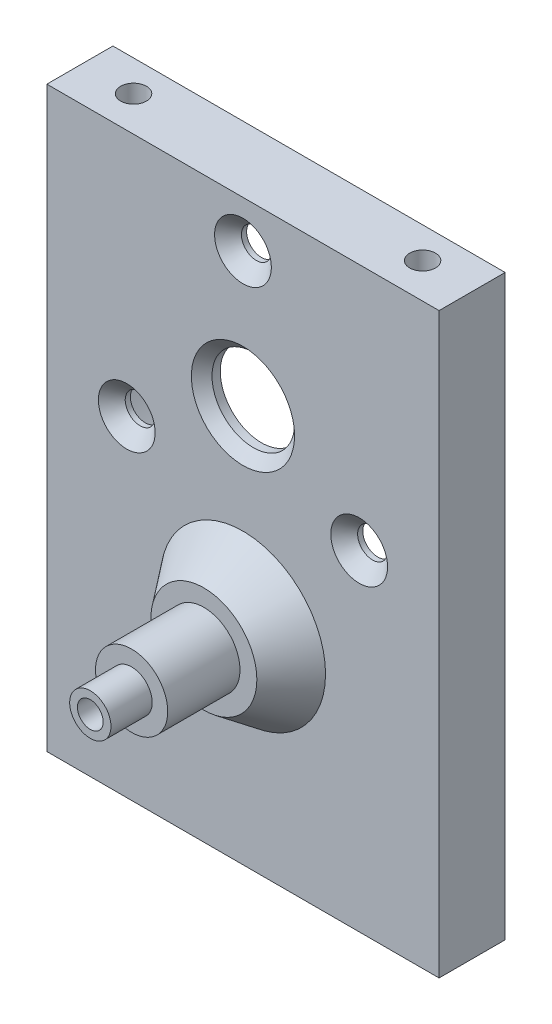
ISO-10303-21;
HEADER;
FILE_DESCRIPTION(('STEP AP214'),'2;1');
FILE_NAME('part.step','',(''),(''),'','','');
FILE_SCHEMA(('AUTOMOTIVE_DESIGN { 1 0 10303 214 1 1 1 1 }'));
ENDSEC;
DATA;
#1=APPLICATION_CONTEXT('core data for automotive mechanical design processes');
#2=APPLICATION_PROTOCOL_DEFINITION('international standard','automotive_design',2000,#1);
#3=PRODUCT_CONTEXT('',#1,'mechanical');
#4=PRODUCT('Part','Part','',(#3));
#5=PRODUCT_RELATED_PRODUCT_CATEGORY('part','',(#4));
#6=PRODUCT_DEFINITION_FORMATION('','',#4);
#7=PRODUCT_DEFINITION_CONTEXT('part definition',#1,'design');
#8=PRODUCT_DEFINITION('design','',#6,#7);
#9=PRODUCT_DEFINITION_SHAPE('','',#8);
#10=(LENGTH_UNIT() NAMED_UNIT(*) SI_UNIT(.MILLI.,.METRE.));
#11=(NAMED_UNIT(*) PLANE_ANGLE_UNIT() SI_UNIT($,.RADIAN.));
#12=(NAMED_UNIT(*) SI_UNIT($,.STERADIAN.) SOLID_ANGLE_UNIT());
#13=UNCERTAINTY_MEASURE_WITH_UNIT(LENGTH_MEASURE(1.E-05),#10,'distance_accuracy_value','');
#14=(GEOMETRIC_REPRESENTATION_CONTEXT(3) GLOBAL_UNCERTAINTY_ASSIGNED_CONTEXT((#13)) GLOBAL_UNIT_ASSIGNED_CONTEXT((#10,
#11,#12)) REPRESENTATION_CONTEXT('',''));
#15=CARTESIAN_POINT('',(0.,0.,0.));
#16=DIRECTION('',(0.,0.,1.));
#17=DIRECTION('',(1.,0.,0.));
#18=AXIS2_PLACEMENT_3D('',#15,#16,#17);
#19=CARTESIAN_POINT('',(0.,20.,17.19));
#20=DIRECTION('',(0.,0.,1.));
#21=DIRECTION('',(1.,0.,0.));
#22=AXIS2_PLACEMENT_3D('',#19,#20,#21);
#23=PLANE('',#22);
#24=CARTESIAN_POINT('',(0.,20.,17.19));
#25=DIRECTION('',(0.,0.,1.));
#26=DIRECTION('',(1.,0.,0.));
#27=AXIS2_PLACEMENT_3D('',#24,#25,#26);
#28=CIRCLE('',#27,3.5);
#29=CARTESIAN_POINT('',(3.5,20.,17.19));
#30=VERTEX_POINT('',#29);
#31=EDGE_CURVE('E115',#30,#30,#28,.T.);
#32=ORIENTED_EDGE('',*,*,#31,.T.);
#33=EDGE_LOOP('',(#32));
#34=FACE_BOUND('',#33,.T.);
#35=CARTESIAN_POINT('',(0.,20.,17.19));
#36=DIRECTION('',(0.,0.,1.));
#37=DIRECTION('',(1.,0.,0.));
#38=AXIS2_PLACEMENT_3D('',#35,#36,#37);
#39=CIRCLE('',#38,2.);
#40=CARTESIAN_POINT('',(2.,20.,17.19));
#41=VERTEX_POINT('',#40);
#42=EDGE_CURVE('E101',#41,#41,#39,.T.);
#43=ORIENTED_EDGE('',*,*,#42,.F.);
#44=EDGE_LOOP('',(#43));
#45=FACE_BOUND('',#44,.T.);
#46=ADVANCED_FACE('F38',(#34,#45),#23,.T.);
#47=CARTESIAN_POINT('',(0.,20.,10.19));
#48=DIRECTION('',(0.,0.,1.));
#49=DIRECTION('',(1.,0.,0.));
#50=AXIS2_PLACEMENT_3D('',#47,#48,#49);
#51=PLANE('',#50);
#52=CARTESIAN_POINT('',(0.,20.,10.19));
#53=DIRECTION('',(0.,0.,1.));
#54=DIRECTION('',(1.,0.,0.));
#55=AXIS2_PLACEMENT_3D('',#52,#53,#54);
#56=CIRCLE('',#55,5.13421550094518);
#57=CARTESIAN_POINT('',(5.13421550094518,20.,10.19));
#58=VERTEX_POINT('',#57);
#59=EDGE_CURVE('E180',#58,#58,#56,.T.);
#60=ORIENTED_EDGE('',*,*,#59,.T.);
#61=EDGE_LOOP('',(#60));
#62=FACE_BOUND('',#61,.T.);
#63=CARTESIAN_POINT('',(0.,20.,10.19));
#64=DIRECTION('',(0.,0.,1.));
#65=DIRECTION('',(1.,0.,0.));
#66=AXIS2_PLACEMENT_3D('',#63,#64,#65);
#67=CIRCLE('',#66,3.5);
#68=CARTESIAN_POINT('',(3.5,20.,10.19));
#69=VERTEX_POINT('',#68);
#70=EDGE_CURVE('E113',#69,#69,#67,.T.);
#71=ORIENTED_EDGE('',*,*,#70,.F.);
#72=EDGE_LOOP('',(#71));
#73=FACE_BOUND('',#72,.T.);
#74=ADVANCED_FACE('F201',(#62,#73),#51,.T.);
#75=CARTESIAN_POINT('',(0.,38.5,4.6));
#76=DIRECTION('',(0.,0.,-1.));
#77=DIRECTION('',(-1.,0.,0.));
#78=AXIS2_PLACEMENT_3D('',#75,#76,#77);
#79=PLANE('',#78);
#80=CARTESIAN_POINT('',(-11.2583302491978,32.,4.6));
#81=DIRECTION('',(0.,0.,-1.));
#82=DIRECTION('',(-1.,0.,0.));
#83=AXIS2_PLACEMENT_3D('',#80,#81,#82);
#84=CIRCLE('',#83,1.44999999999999);
#85=CARTESIAN_POINT('',(-12.7083302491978,32.,4.6));
#86=VERTEX_POINT('',#85);
#87=EDGE_CURVE('E143',#86,#86,#84,.F.);
#88=ORIENTED_EDGE('',*,*,#87,.T.);
#89=EDGE_LOOP('',(#88));
#90=FACE_BOUND('',#89,.T.);
#91=CARTESIAN_POINT('',(0.,38.5,4.6));
#92=DIRECTION('',(0.,0.,-1.));
#93=DIRECTION('',(-1.,0.,0.));
#94=AXIS2_PLACEMENT_3D('',#91,#92,#93);
#95=CIRCLE('',#94,4.00000000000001);
#96=CARTESIAN_POINT('',(-4.00000000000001,38.5,4.6));
#97=VERTEX_POINT('',#96);
#98=EDGE_CURVE('E142',#97,#97,#95,.T.);
#99=ORIENTED_EDGE('',*,*,#98,.F.);
#100=EDGE_LOOP('',(#99));
#101=FACE_BOUND('',#100,.T.);
#102=CARTESIAN_POINT('',(0.,38.5,4.6));
#103=DIRECTION('',(0.,0.,-1.));
#104=DIRECTION('',(-1.,0.,0.));
#105=AXIS2_PLACEMENT_3D('',#102,#103,#104);
#106=CIRCLE('',#105,16.54);
#107=CARTESIAN_POINT('',(-16.54,38.5,4.6));
#108=VERTEX_POINT('',#107);
#109=EDGE_CURVE('E151',#108,#108,#106,.T.);
#110=ORIENTED_EDGE('',*,*,#109,.T.);
#111=EDGE_LOOP('',(#110));
#112=FACE_BOUND('',#111,.T.);
#113=CARTESIAN_POINT('',(11.2583302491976,31.9999999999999,4.6));
#114=DIRECTION('',(0.,0.,-1.));
#115=DIRECTION('',(-1.,0.,0.));
#116=AXIS2_PLACEMENT_3D('',#113,#114,#115);
#117=CIRCLE('',#116,1.44999999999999);
#118=CARTESIAN_POINT('',(9.80833024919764,31.9999999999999,4.6));
#119=VERTEX_POINT('',#118);
#120=EDGE_CURVE('E134',#119,#119,#117,.F.);
#121=ORIENTED_EDGE('',*,*,#120,.T.);
#122=EDGE_LOOP('',(#121));
#123=FACE_BOUND('',#122,.T.);
#124=CARTESIAN_POINT('',(0.,51.5,4.6));
#125=DIRECTION('',(0.,0.,-1.));
#126=DIRECTION('',(-1.,0.,0.));
#127=AXIS2_PLACEMENT_3D('',#124,#125,#126);
#128=CIRCLE('',#127,1.44999999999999);
#129=CARTESIAN_POINT('',(-1.44999999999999,51.5,4.6));
#130=VERTEX_POINT('',#129);
#131=EDGE_CURVE('E125',#130,#130,#128,.F.);
#132=ORIENTED_EDGE('',*,*,#131,.T.);
#133=EDGE_LOOP('',(#132));
#134=FACE_BOUND('',#133,.T.);
#135=ADVANCED_FACE('F207',(#90,#101,#112,#123,#134),#79,.T.);
#136=CARTESIAN_POINT('',(19.,56.,6.4));
#137=DIRECTION('',(0.,0.,1.));
#138=DIRECTION('',(1.,0.,0.));
#139=AXIS2_PLACEMENT_3D('',#136,#137,#138);
#140=PLANE('',#139);
#141=CARTESIAN_POINT('',(0.,38.5,6.4));
#142=DIRECTION('',(0.,0.,1.));
#143=DIRECTION('',(1.,0.,0.));
#144=AXIS2_PLACEMENT_3D('',#141,#142,#143);
#145=CIRCLE('',#144,5.);
#146=CARTESIAN_POINT('',(5.,38.5,6.4));
#147=VERTEX_POINT('',#146);
#148=EDGE_CURVE('E47',#147,#147,#145,.F.);
#149=ORIENTED_EDGE('',*,*,#148,.T.);
#150=EDGE_LOOP('',(#149));
#151=FACE_BOUND('',#150,.T.);
#152=CARTESIAN_POINT('',(0.,20.,6.4));
#153=DIRECTION('',(0.,0.,1.));
#154=DIRECTION('',(1.,0.,0.));
#155=AXIS2_PLACEMENT_3D('',#152,#153,#154);
#156=CIRCLE('',#155,8.);
#157=CARTESIAN_POINT('',(8.,20.,6.4));
#158=VERTEX_POINT('',#157);
#159=EDGE_CURVE('E177',#158,#158,#156,.F.);
#160=ORIENTED_EDGE('',*,*,#159,.T.);
#161=EDGE_LOOP('',(#160));
#162=FACE_BOUND('',#161,.T.);
#163=CARTESIAN_POINT('',(0.,51.5,6.4));
#164=DIRECTION('',(0.,0.,1.));
#165=DIRECTION('',(1.,0.,0.));
#166=AXIS2_PLACEMENT_3D('',#163,#164,#165);
#167=CIRCLE('',#166,2.75);
#168=CARTESIAN_POINT('',(2.75,51.5,6.4));
#169=VERTEX_POINT('',#168);
#170=EDGE_CURVE('E118',#169,#169,#167,.T.);
#171=ORIENTED_EDGE('',*,*,#170,.F.);
#172=EDGE_LOOP('',(#171));
#173=FACE_BOUND('',#172,.T.);
#174=CARTESIAN_POINT('',(11.2583302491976,31.9999999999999,6.4));
#175=DIRECTION('',(0.,0.,1.));
#176=DIRECTION('',(1.,0.,0.));
#177=AXIS2_PLACEMENT_3D('',#174,#175,#176);
#178=CIRCLE('',#177,2.75);
#179=CARTESIAN_POINT('',(14.0083302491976,31.9999999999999,6.4));
#180=VERTEX_POINT('',#179);
#181=EDGE_CURVE('E124',#180,#180,#178,.T.);
#182=ORIENTED_EDGE('',*,*,#181,.F.);
#183=EDGE_LOOP('',(#182));
#184=FACE_BOUND('',#183,.T.);
#185=CARTESIAN_POINT('',(-11.2583302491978,32.,6.4));
#186=DIRECTION('',(0.,0.,1.));
#187=DIRECTION('',(1.,0.,0.));
#188=AXIS2_PLACEMENT_3D('',#185,#186,#187);
#189=CIRCLE('',#188,2.75);
#190=CARTESIAN_POINT('',(-8.50833024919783,32.,6.4));
#191=VERTEX_POINT('',#190);
#192=EDGE_CURVE('E133',#191,#191,#189,.T.);
#193=ORIENTED_EDGE('',*,*,#192,.F.);
#194=EDGE_LOOP('',(#193));
#195=FACE_BOUND('',#194,.T.);
#196=DIRECTION('',(0.,1.,0.));
#197=VECTOR('',#196,1.);
#198=CARTESIAN_POINT('',(19.,0.,6.4));
#199=LINE('',#198,#197);
#200=CARTESIAN_POINT('',(19.,0.,6.4));
#201=VERTEX_POINT('',#200);
#202=CARTESIAN_POINT('',(19.,56.,6.4));
#203=VERTEX_POINT('',#202);
#204=EDGE_CURVE('E157',#201,#203,#199,.T.);
#205=ORIENTED_EDGE('',*,*,#204,.T.);
#206=DIRECTION('',(-1.,0.,0.));
#207=VECTOR('',#206,1.);
#208=CARTESIAN_POINT('',(19.,56.,6.4));
#209=LINE('',#208,#207);
#210=CARTESIAN_POINT('',(-19.,56.,6.4));
#211=VERTEX_POINT('',#210);
#212=EDGE_CURVE('E87',#203,#211,#209,.T.);
#213=ORIENTED_EDGE('',*,*,#212,.T.);
#214=DIRECTION('',(0.,-1.,0.));
#215=VECTOR('',#214,1.);
#216=CARTESIAN_POINT('',(-19.,56.,6.4));
#217=LINE('',#216,#215);
#218=CARTESIAN_POINT('',(-19.,0.,6.4));
#219=VERTEX_POINT('',#218);
#220=EDGE_CURVE('E160',#211,#219,#217,.T.);
#221=ORIENTED_EDGE('',*,*,#220,.T.);
#222=DIRECTION('',(1.,0.,0.));
#223=VECTOR('',#222,1.);
#224=CARTESIAN_POINT('',(-19.,0.,6.4));
#225=LINE('',#224,#223);
#226=EDGE_CURVE('E55',#219,#201,#225,.T.);
#227=ORIENTED_EDGE('',*,*,#226,.T.);
#228=EDGE_LOOP('',(#205,#213,#221,#227));
#229=FACE_BOUND('',#228,.T.);
#230=ADVANCED_FACE('F185',(#151,#162,#173,#184,#195,#229),#140,.T.);
#231=CARTESIAN_POINT('',(19.,56.,0.));
#232=DIRECTION('',(0.,0.,1.));
#233=DIRECTION('',(1.,0.,0.));
#234=AXIS2_PLACEMENT_3D('',#231,#232,#233);
#235=PLANE('',#234);
#236=DIRECTION('',(0.,1.,0.));
#237=VECTOR('',#236,1.);
#238=CARTESIAN_POINT('',(19.,0.,0.));
#239=LINE('',#238,#237);
#240=CARTESIAN_POINT('',(19.,0.,0.));
#241=VERTEX_POINT('',#240);
#242=CARTESIAN_POINT('',(19.,56.,0.));
#243=VERTEX_POINT('',#242);
#244=EDGE_CURVE('E154',#241,#243,#239,.T.);
#245=ORIENTED_EDGE('',*,*,#244,.F.);
#246=DIRECTION('',(1.,0.,0.));
#247=VECTOR('',#246,1.);
#248=CARTESIAN_POINT('',(-19.,0.,0.));
#249=LINE('',#248,#247);
#250=CARTESIAN_POINT('',(-19.,0.,0.));
#251=VERTEX_POINT('',#250);
#252=EDGE_CURVE('E79',#251,#241,#249,.T.);
#253=ORIENTED_EDGE('',*,*,#252,.F.);
#254=DIRECTION('',(0.,-1.,0.));
#255=VECTOR('',#254,1.);
#256=CARTESIAN_POINT('',(-19.,56.,0.));
#257=LINE('',#256,#255);
#258=CARTESIAN_POINT('',(-19.,56.,0.));
#259=VERTEX_POINT('',#258);
#260=EDGE_CURVE('E73',#259,#251,#257,.T.);
#261=ORIENTED_EDGE('',*,*,#260,.F.);
#262=DIRECTION('',(-1.,0.,0.));
#263=VECTOR('',#262,1.);
#264=CARTESIAN_POINT('',(19.,56.,0.));
#265=LINE('',#264,#263);
#266=EDGE_CURVE('E166',#243,#259,#265,.T.);
#267=ORIENTED_EDGE('',*,*,#266,.F.);
#268=EDGE_LOOP('',(#245,#253,#261,#267));
#269=FACE_BOUND('',#268,.T.);
#270=CARTESIAN_POINT('',(0.,38.5,0.));
#271=DIRECTION('',(0.,0.,-1.));
#272=DIRECTION('',(-1.,0.,0.));
#273=AXIS2_PLACEMENT_3D('',#270,#271,#272);
#274=CIRCLE('',#273,16.54);
#275=CARTESIAN_POINT('',(-16.54,38.5,0.));
#276=VERTEX_POINT('',#275);
#277=EDGE_CURVE('E150',#276,#276,#274,.T.);
#278=ORIENTED_EDGE('',*,*,#277,.F.);
#279=EDGE_LOOP('',(#278));
#280=FACE_BOUND('',#279,.T.);
#281=ADVANCED_FACE('F257',(#269,#280),#235,.F.);
#282=CARTESIAN_POINT('',(19.,0.,6.4));
#283=DIRECTION('',(-1.,0.,0.));
#284=DIRECTION('',(0.,0.,1.));
#285=AXIS2_PLACEMENT_3D('',#282,#283,#284);
#286=PLANE('',#285);
#287=ORIENTED_EDGE('',*,*,#244,.T.);
#288=DIRECTION('',(0.,0.,-1.));
#289=VECTOR('',#288,1.);
#290=CARTESIAN_POINT('',(19.,56.,6.4));
#291=LINE('',#290,#289);
#292=EDGE_CURVE('E175',#203,#243,#291,.T.);
#293=ORIENTED_EDGE('',*,*,#292,.F.);
#294=ORIENTED_EDGE('',*,*,#204,.F.);
#295=DIRECTION('',(0.,0.,-1.));
#296=VECTOR('',#295,1.);
#297=CARTESIAN_POINT('',(19.,0.,6.4));
#298=LINE('',#297,#296);
#299=EDGE_CURVE('E163',#201,#241,#298,.T.);
#300=ORIENTED_EDGE('',*,*,#299,.T.);
#301=EDGE_LOOP('',(#287,#293,#294,#300));
#302=FACE_BOUND('',#301,.T.);
#303=ADVANCED_FACE('F260',(#302),#286,.F.);
#304=CARTESIAN_POINT('',(19.,56.,6.4));
#305=DIRECTION('',(0.,-1.,0.));
#306=DIRECTION('',(1.,0.,0.));
#307=AXIS2_PLACEMENT_3D('',#304,#305,#306);
#308=PLANE('',#307);
#309=CARTESIAN_POINT('',(-14.,56.,3.));
#310=DIRECTION('',(0.,1.,0.));
#311=DIRECTION('',(-1.,0.,0.));
#312=AXIS2_PLACEMENT_3D('',#309,#310,#311);
#313=CIRCLE('',#312,1.25);
#314=CARTESIAN_POINT('',(-15.25,56.,3.));
#315=VERTEX_POINT('',#314);
#316=EDGE_CURVE('E381',#315,#315,#313,.T.);
#317=ORIENTED_EDGE('',*,*,#316,.F.);
#318=EDGE_LOOP('',(#317));
#319=FACE_BOUND('',#318,.T.);
#320=CARTESIAN_POINT('',(14.,56.,3.));
#321=DIRECTION('',(0.,1.,0.));
#322=DIRECTION('',(1.,0.,0.));
#323=AXIS2_PLACEMENT_3D('',#320,#321,#322);
#324=CIRCLE('',#323,1.25);
#325=CARTESIAN_POINT('',(15.25,56.,3.));
#326=VERTEX_POINT('',#325);
#327=EDGE_CURVE('E359',#326,#326,#324,.T.);
#328=ORIENTED_EDGE('',*,*,#327,.F.);
#329=EDGE_LOOP('',(#328));
#330=FACE_BOUND('',#329,.T.);
#331=ORIENTED_EDGE('',*,*,#266,.T.);
#332=DIRECTION('',(0.,0.,-1.));
#333=VECTOR('',#332,1.);
#334=CARTESIAN_POINT('',(-19.,56.,6.4));
#335=LINE('',#334,#333);
#336=EDGE_CURVE('E173',#211,#259,#335,.T.);
#337=ORIENTED_EDGE('',*,*,#336,.F.);
#338=ORIENTED_EDGE('',*,*,#212,.F.);
#339=ORIENTED_EDGE('',*,*,#292,.T.);
#340=EDGE_LOOP('',(#331,#337,#338,#339));
#341=FACE_BOUND('',#340,.T.);
#342=ADVANCED_FACE('F268',(#319,#330,#341),#308,.F.);
#343=CARTESIAN_POINT('',(-19.,56.,6.4));
#344=DIRECTION('',(1.,0.,0.));
#345=DIRECTION('',(0.,0.,-1.));
#346=AXIS2_PLACEMENT_3D('',#343,#344,#345);
#347=PLANE('',#346);
#348=ORIENTED_EDGE('',*,*,#260,.T.);
#349=DIRECTION('',(0.,0.,-1.));
#350=VECTOR('',#349,1.);
#351=CARTESIAN_POINT('',(-19.,0.,6.4));
#352=LINE('',#351,#350);
#353=EDGE_CURVE('E171',#219,#251,#352,.T.);
#354=ORIENTED_EDGE('',*,*,#353,.F.);
#355=ORIENTED_EDGE('',*,*,#220,.F.);
#356=ORIENTED_EDGE('',*,*,#336,.T.);
#357=EDGE_LOOP('',(#348,#354,#355,#356));
#358=FACE_BOUND('',#357,.T.);
#359=ADVANCED_FACE('F264',(#358),#347,.F.);
#360=CARTESIAN_POINT('',(-19.,0.,6.4));
#361=DIRECTION('',(0.,1.,0.));
#362=DIRECTION('',(0.,0.,1.));
#363=AXIS2_PLACEMENT_3D('',#360,#361,#362);
#364=PLANE('',#363);
#365=CARTESIAN_POINT('',(12.,0.,3.));
#366=DIRECTION('',(0.,-1.,0.));
#367=DIRECTION('',(0.,0.,-1.));
#368=AXIS2_PLACEMENT_3D('',#365,#366,#367);
#369=CIRCLE('',#368,1.25);
#370=CARTESIAN_POINT('',(12.,0.,1.75));
#371=VERTEX_POINT('',#370);
#372=EDGE_CURVE('E360',#371,#371,#369,.T.);
#373=ORIENTED_EDGE('',*,*,#372,.F.);
#374=EDGE_LOOP('',(#373));
#375=FACE_BOUND('',#374,.T.);
#376=CARTESIAN_POINT('',(0.,0.,3.));
#377=DIRECTION('',(0.,-1.,0.));
#378=DIRECTION('',(0.,0.,-1.));
#379=AXIS2_PLACEMENT_3D('',#376,#377,#378);
#380=CIRCLE('',#379,1.25);
#381=CARTESIAN_POINT('',(0.,0.,1.75));
#382=VERTEX_POINT('',#381);
#383=EDGE_CURVE('E370',#382,#382,#380,.T.);
#384=ORIENTED_EDGE('',*,*,#383,.F.);
#385=EDGE_LOOP('',(#384));
#386=FACE_BOUND('',#385,.T.);
#387=CARTESIAN_POINT('',(-12.,0.,3.));
#388=DIRECTION('',(0.,-1.,0.));
#389=DIRECTION('',(0.,0.,1.));
#390=AXIS2_PLACEMENT_3D('',#387,#388,#389);
#391=CIRCLE('',#390,1.25);
#392=CARTESIAN_POINT('',(-12.,0.,4.25));
#393=VERTEX_POINT('',#392);
#394=EDGE_CURVE('E376',#393,#393,#391,.T.);
#395=ORIENTED_EDGE('',*,*,#394,.F.);
#396=EDGE_LOOP('',(#395));
#397=FACE_BOUND('',#396,.T.);
#398=ORIENTED_EDGE('',*,*,#252,.T.);
#399=ORIENTED_EDGE('',*,*,#299,.F.);
#400=ORIENTED_EDGE('',*,*,#226,.F.);
#401=ORIENTED_EDGE('',*,*,#353,.T.);
#402=EDGE_LOOP('',(#398,#399,#400,#401));
#403=FACE_BOUND('',#402,.T.);
#404=ADVANCED_FACE('F253',(#375,#386,#397,#403),#364,.F.);
#405=CARTESIAN_POINT('',(0.,38.5,4.6));
#406=DIRECTION('',(0.,0.,-1.));
#407=DIRECTION('',(-1.,0.,0.));
#408=AXIS2_PLACEMENT_3D('',#405,#406,#407);
#409=CYLINDRICAL_SURFACE('',#408,16.54);
#410=ORIENTED_EDGE('',*,*,#277,.T.);
#411=EDGE_LOOP('',(#410));
#412=FACE_BOUND('',#411,.T.);
#413=ORIENTED_EDGE('',*,*,#109,.F.);
#414=EDGE_LOOP('',(#413));
#415=FACE_BOUND('',#414,.T.);
#416=ADVANCED_FACE('F246',(#412,#415),#409,.F.);
#417=CARTESIAN_POINT('',(0.,38.5,6.4));
#418=DIRECTION('',(0.,0.,-1.));
#419=DIRECTION('',(-1.,0.,0.));
#420=AXIS2_PLACEMENT_3D('',#417,#418,#419);
#421=CYLINDRICAL_SURFACE('',#420,4.00000000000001);
#422=CARTESIAN_POINT('',(0.,38.5,5.40000000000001));
#423=DIRECTION('',(0.,0.,1.));
#424=DIRECTION('',(1.,0.,0.));
#425=AXIS2_PLACEMENT_3D('',#422,#423,#424);
#426=CIRCLE('',#425,4.00000000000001);
#427=CARTESIAN_POINT('',(4.00000000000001,38.5,5.40000000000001));
#428=VERTEX_POINT('',#427);
#429=EDGE_CURVE('E11',#428,#428,#426,.T.);
#430=ORIENTED_EDGE('',*,*,#429,.T.);
#431=EDGE_LOOP('',(#430));
#432=FACE_BOUND('',#431,.T.);
#433=ORIENTED_EDGE('',*,*,#98,.T.);
#434=EDGE_LOOP('',(#433));
#435=FACE_BOUND('',#434,.T.);
#436=ADVANCED_FACE('F239',(#432,#435),#421,.F.);
#437=CARTESIAN_POINT('',(-11.2583302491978,32.,6.4));
#438=DIRECTION('',(0.,0.,1.));
#439=DIRECTION('',(1.,0.,0.));
#440=AXIS2_PLACEMENT_3D('',#437,#438,#439);
#441=CYLINDRICAL_SURFACE('',#440,1.44999999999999);
#442=ORIENTED_EDGE('',*,*,#87,.F.);
#443=EDGE_LOOP('',(#442));
#444=FACE_BOUND('',#443,.T.);
#445=CARTESIAN_POINT('',(-11.2583302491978,32.,5.09999999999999));
#446=DIRECTION('',(0.,0.,1.));
#447=DIRECTION('',(1.,0.,0.));
#448=AXIS2_PLACEMENT_3D('',#445,#446,#447);
#449=CIRCLE('',#448,1.44999999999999);
#450=CARTESIAN_POINT('',(-9.80833024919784,32.,5.09999999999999));
#451=VERTEX_POINT('',#450);
#452=EDGE_CURVE('E139',#451,#451,#449,.T.);
#453=ORIENTED_EDGE('',*,*,#452,.T.);
#454=EDGE_LOOP('',(#453));
#455=FACE_BOUND('',#454,.T.);
#456=ADVANCED_FACE('F236',(#444,#455),#441,.F.);
#457=CARTESIAN_POINT('',(-11.2583302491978,32.,6.4));
#458=DIRECTION('',(0.,0.,1.));
#459=DIRECTION('',(1.,0.,0.));
#460=AXIS2_PLACEMENT_3D('',#457,#458,#459);
#461=CONICAL_SURFACE('',#460,2.75,0.785398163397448);
#462=ORIENTED_EDGE('',*,*,#452,.F.);
#463=EDGE_LOOP('',(#462));
#464=FACE_BOUND('',#463,.T.);
#465=ORIENTED_EDGE('',*,*,#192,.T.);
#466=EDGE_LOOP('',(#465));
#467=FACE_BOUND('',#466,.T.);
#468=ADVANCED_FACE('F231',(#464,#467),#461,.F.);
#469=CARTESIAN_POINT('',(11.2583302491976,31.9999999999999,6.4));
#470=DIRECTION('',(0.,0.,1.));
#471=DIRECTION('',(1.,0.,0.));
#472=AXIS2_PLACEMENT_3D('',#469,#470,#471);
#473=CYLINDRICAL_SURFACE('',#472,1.44999999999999);
#474=ORIENTED_EDGE('',*,*,#120,.F.);
#475=EDGE_LOOP('',(#474));
#476=FACE_BOUND('',#475,.T.);
#477=CARTESIAN_POINT('',(11.2583302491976,31.9999999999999,5.09999999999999));
#478=DIRECTION('',(0.,0.,1.));
#479=DIRECTION('',(1.,0.,0.));
#480=AXIS2_PLACEMENT_3D('',#477,#478,#479);
#481=CIRCLE('',#480,1.44999999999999);
#482=CARTESIAN_POINT('',(12.7083302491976,31.9999999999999,5.09999999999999));
#483=VERTEX_POINT('',#482);
#484=EDGE_CURVE('E130',#483,#483,#481,.T.);
#485=ORIENTED_EDGE('',*,*,#484,.T.);
#486=EDGE_LOOP('',(#485));
#487=FACE_BOUND('',#486,.T.);
#488=ADVANCED_FACE('F228',(#476,#487),#473,.F.);
#489=CARTESIAN_POINT('',(11.2583302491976,31.9999999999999,6.4));
#490=DIRECTION('',(0.,0.,1.));
#491=DIRECTION('',(1.,0.,0.));
#492=AXIS2_PLACEMENT_3D('',#489,#490,#491);
#493=CONICAL_SURFACE('',#492,2.75,0.785398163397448);
#494=ORIENTED_EDGE('',*,*,#484,.F.);
#495=EDGE_LOOP('',(#494));
#496=FACE_BOUND('',#495,.T.);
#497=ORIENTED_EDGE('',*,*,#181,.T.);
#498=EDGE_LOOP('',(#497));
#499=FACE_BOUND('',#498,.T.);
#500=ADVANCED_FACE('F223',(#496,#499),#493,.F.);
#501=CARTESIAN_POINT('',(0.,51.5,6.4));
#502=DIRECTION('',(0.,0.,1.));
#503=DIRECTION('',(1.,0.,0.));
#504=AXIS2_PLACEMENT_3D('',#501,#502,#503);
#505=CYLINDRICAL_SURFACE('',#504,1.44999999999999);
#506=ORIENTED_EDGE('',*,*,#131,.F.);
#507=EDGE_LOOP('',(#506));
#508=FACE_BOUND('',#507,.T.);
#509=CARTESIAN_POINT('',(0.,51.5,5.09999999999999));
#510=DIRECTION('',(0.,0.,1.));
#511=DIRECTION('',(1.,0.,0.));
#512=AXIS2_PLACEMENT_3D('',#509,#510,#511);
#513=CIRCLE('',#512,1.44999999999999);
#514=CARTESIAN_POINT('',(1.44999999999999,51.5,5.09999999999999));
#515=VERTEX_POINT('',#514);
#516=EDGE_CURVE('E121',#515,#515,#513,.T.);
#517=ORIENTED_EDGE('',*,*,#516,.T.);
#518=EDGE_LOOP('',(#517));
#519=FACE_BOUND('',#518,.T.);
#520=ADVANCED_FACE('F220',(#508,#519),#505,.F.);
#521=CARTESIAN_POINT('',(0.,51.5,6.4));
#522=DIRECTION('',(0.,0.,1.));
#523=DIRECTION('',(1.,0.,0.));
#524=AXIS2_PLACEMENT_3D('',#521,#522,#523);
#525=CONICAL_SURFACE('',#524,2.75,0.785398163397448);
#526=ORIENTED_EDGE('',*,*,#516,.F.);
#527=EDGE_LOOP('',(#526));
#528=FACE_BOUND('',#527,.T.);
#529=ORIENTED_EDGE('',*,*,#170,.T.);
#530=EDGE_LOOP('',(#529));
#531=FACE_BOUND('',#530,.T.);
#532=ADVANCED_FACE('F217',(#528,#531),#525,.F.);
#533=CARTESIAN_POINT('',(0.,20.,17.19));
#534=DIRECTION('',(0.,0.,-1.));
#535=DIRECTION('',(-1.,0.,0.));
#536=AXIS2_PLACEMENT_3D('',#533,#534,#535);
#537=CYLINDRICAL_SURFACE('',#536,3.5);
#538=ORIENTED_EDGE('',*,*,#31,.F.);
#539=EDGE_LOOP('',(#538));
#540=FACE_BOUND('',#539,.T.);
#541=ORIENTED_EDGE('',*,*,#70,.T.);
#542=EDGE_LOOP('',(#541));
#543=FACE_BOUND('',#542,.T.);
#544=ADVANCED_FACE('F215',(#540,#543),#537,.T.);
#545=CARTESIAN_POINT('',(0.,20.,21.19));
#546=DIRECTION('',(0.,0.,-1.));
#547=DIRECTION('',(-1.,0.,0.));
#548=AXIS2_PLACEMENT_3D('',#545,#546,#547);
#549=CYLINDRICAL_SURFACE('',#548,2.);
#550=CARTESIAN_POINT('',(0.,20.,21.19));
#551=DIRECTION('',(0.,0.,1.));
#552=DIRECTION('',(1.,0.,0.));
#553=AXIS2_PLACEMENT_3D('',#550,#551,#552);
#554=CIRCLE('',#553,2.);
#555=CARTESIAN_POINT('',(2.,20.,21.19));
#556=VERTEX_POINT('',#555);
#557=EDGE_CURVE('E105',#556,#556,#554,.T.);
#558=ORIENTED_EDGE('',*,*,#557,.F.);
#559=EDGE_LOOP('',(#558));
#560=FACE_BOUND('',#559,.T.);
#561=ORIENTED_EDGE('',*,*,#42,.T.);
#562=EDGE_LOOP('',(#561));
#563=FACE_BOUND('',#562,.T.);
#564=ADVANCED_FACE('F213',(#560,#563),#549,.T.);
#565=CARTESIAN_POINT('',(0.,20.,21.19));
#566=DIRECTION('',(0.,0.,1.));
#567=DIRECTION('',(1.,0.,0.));
#568=AXIS2_PLACEMENT_3D('',#565,#566,#567);
#569=PLANE('',#568);
#570=CARTESIAN_POINT('',(0.,20.,21.19));
#571=DIRECTION('',(0.,0.,1.));
#572=DIRECTION('',(1.,0.,0.));
#573=AXIS2_PLACEMENT_3D('',#570,#571,#572);
#574=CIRCLE('',#573,1.24999999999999);
#575=CARTESIAN_POINT('',(1.24999999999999,20.,21.19));
#576=VERTEX_POINT('',#575);
#577=EDGE_CURVE('E102',#576,#576,#574,.T.);
#578=ORIENTED_EDGE('',*,*,#577,.F.);
#579=EDGE_LOOP('',(#578));
#580=FACE_BOUND('',#579,.T.);
#581=ORIENTED_EDGE('',*,*,#557,.T.);
#582=EDGE_LOOP('',(#581));
#583=FACE_BOUND('',#582,.T.);
#584=ADVANCED_FACE('F275',(#580,#583),#569,.T.);
#585=CARTESIAN_POINT('',(0.,20.,11.69));
#586=DIRECTION('',(0.,0.,-1.));
#587=DIRECTION('',(-1.,0.,0.));
#588=AXIS2_PLACEMENT_3D('',#585,#586,#587);
#589=CONICAL_SURFACE('',#588,4.,0.647421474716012);
#590=ORIENTED_EDGE('',*,*,#159,.F.);
#591=EDGE_LOOP('',(#590));
#592=FACE_BOUND('',#591,.T.);
#593=ORIENTED_EDGE('',*,*,#59,.F.);
#594=EDGE_LOOP('',(#593));
#595=FACE_BOUND('',#594,.T.);
#596=ADVANCED_FACE('F95',(#592,#595),#589,.T.);
#597=CARTESIAN_POINT('',(0.,20.,11.19));
#598=DIRECTION('',(0.,0.,1.));
#599=DIRECTION('',(1.,0.,0.));
#600=AXIS2_PLACEMENT_3D('',#597,#598,#599);
#601=CONICAL_SURFACE('',#600,1.25,1.02974425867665);
#602=CARTESIAN_POINT('',(0.,20.,10.4389242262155));
#603=VERTEX_POINT('',#602);
#604=VERTEX_LOOP('',#603);
#605=FACE_BOUND('',#604,.T.);
#606=CARTESIAN_POINT('',(0.,20.,11.19));
#607=DIRECTION('',(0.,0.,1.));
#608=DIRECTION('',(1.,0.,0.));
#609=AXIS2_PLACEMENT_3D('',#606,#607,#608);
#610=CIRCLE('',#609,1.25);
#611=CARTESIAN_POINT('',(1.25,20.,11.19));
#612=VERTEX_POINT('',#611);
#613=EDGE_CURVE('E99',#612,#612,#610,.T.);
#614=ORIENTED_EDGE('',*,*,#613,.T.);
#615=EDGE_LOOP('',(#614));
#616=FACE_BOUND('',#615,.T.);
#617=ADVANCED_FACE('F91',(#605,#616),#601,.F.);
#618=CARTESIAN_POINT('',(0.,20.,21.19));
#619=DIRECTION('',(0.,0.,1.));
#620=DIRECTION('',(1.,0.,0.));
#621=AXIS2_PLACEMENT_3D('',#618,#619,#620);
#622=CYLINDRICAL_SURFACE('',#621,1.24999999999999);
#623=ORIENTED_EDGE('',*,*,#613,.F.);
#624=EDGE_LOOP('',(#623));
#625=FACE_BOUND('',#624,.T.);
#626=ORIENTED_EDGE('',*,*,#577,.T.);
#627=EDGE_LOOP('',(#626));
#628=FACE_BOUND('',#627,.T.);
#629=ADVANCED_FACE('F94',(#625,#628),#622,.F.);
#630=CARTESIAN_POINT('',(0.,38.5,6.4));
#631=DIRECTION('',(0.,0.,1.));
#632=DIRECTION('',(1.,0.,0.));
#633=AXIS2_PLACEMENT_3D('',#630,#631,#632);
#634=CONICAL_SURFACE('',#633,5.,0.785398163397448);
#635=ORIENTED_EDGE('',*,*,#429,.F.);
#636=EDGE_LOOP('',(#635));
#637=FACE_BOUND('',#636,.T.);
#638=ORIENTED_EDGE('',*,*,#148,.F.);
#639=EDGE_LOOP('',(#638));
#640=FACE_BOUND('',#639,.T.);
#641=ADVANCED_FACE('F40',(#637,#640),#634,.F.);
#642=CARTESIAN_POINT('',(14.,50.,3.));
#643=DIRECTION('',(0.,1.,0.));
#644=DIRECTION('',(-1.,0.,0.));
#645=AXIS2_PLACEMENT_3D('',#642,#643,#644);
#646=CYLINDRICAL_SURFACE('',#645,1.25);
#647=CARTESIAN_POINT('',(14.,50.,3.));
#648=DIRECTION('',(0.,1.,0.));
#649=DIRECTION('',(1.,0.,0.));
#650=AXIS2_PLACEMENT_3D('',#647,#648,#649);
#651=CIRCLE('',#650,1.25);
#652=CARTESIAN_POINT('',(15.25,50.,3.));
#653=VERTEX_POINT('',#652);
#654=EDGE_CURVE('E363',#653,#653,#651,.T.);
#655=ORIENTED_EDGE('',*,*,#654,.F.);
#656=EDGE_LOOP('',(#655));
#657=FACE_BOUND('',#656,.T.);
#658=ORIENTED_EDGE('',*,*,#327,.T.);
#659=EDGE_LOOP('',(#658));
#660=FACE_BOUND('',#659,.T.);
#661=ADVANCED_FACE('F189',(#657,#660),#646,.F.);
#662=CARTESIAN_POINT('',(14.,50.,3.));
#663=DIRECTION('',(0.,-1.,0.));
#664=DIRECTION('',(1.,0.,0.));
#665=AXIS2_PLACEMENT_3D('',#662,#663,#664);
#666=PLANE('',#665);
#667=ORIENTED_EDGE('',*,*,#654,.T.);
#668=EDGE_LOOP('',(#667));
#669=FACE_BOUND('',#668,.T.);
#670=ADVANCED_FACE('F195',(#669),#666,.F.);
#671=CARTESIAN_POINT('',(-14.,50.,3.));
#672=DIRECTION('',(0.,1.,0.));
#673=DIRECTION('',(-1.,0.,0.));
#674=AXIS2_PLACEMENT_3D('',#671,#672,#673);
#675=CYLINDRICAL_SURFACE('',#674,1.25);
#676=CARTESIAN_POINT('',(-14.,50.,3.));
#677=DIRECTION('',(0.,1.,0.));
#678=DIRECTION('',(-1.,0.,0.));
#679=AXIS2_PLACEMENT_3D('',#676,#677,#678);
#680=CIRCLE('',#679,1.25);
#681=CARTESIAN_POINT('',(-15.25,50.,3.));
#682=VERTEX_POINT('',#681);
#683=EDGE_CURVE('E108',#682,#682,#680,.T.);
#684=ORIENTED_EDGE('',*,*,#683,.F.);
#685=EDGE_LOOP('',(#684));
#686=FACE_BOUND('',#685,.T.);
#687=ORIENTED_EDGE('',*,*,#316,.T.);
#688=EDGE_LOOP('',(#687));
#689=FACE_BOUND('',#688,.T.);
#690=ADVANCED_FACE('F322',(#686,#689),#675,.F.);
#691=CARTESIAN_POINT('',(-14.,50.,3.));
#692=DIRECTION('',(0.,1.,0.));
#693=DIRECTION('',(-1.,0.,0.));
#694=AXIS2_PLACEMENT_3D('',#691,#692,#693);
#695=PLANE('',#694);
#696=ORIENTED_EDGE('',*,*,#683,.T.);
#697=EDGE_LOOP('',(#696));
#698=FACE_BOUND('',#697,.T.);
#699=ADVANCED_FACE('F326',(#698),#695,.T.);
#700=CARTESIAN_POINT('',(-12.,10.,3.));
#701=DIRECTION('',(0.,-1.,0.));
#702=DIRECTION('',(0.,0.,-1.));
#703=AXIS2_PLACEMENT_3D('',#700,#701,#702);
#704=CYLINDRICAL_SURFACE('',#703,1.25);
#705=CARTESIAN_POINT('',(-12.,10.,3.));
#706=DIRECTION('',(0.,-1.,0.));
#707=DIRECTION('',(0.,0.,1.));
#708=AXIS2_PLACEMENT_3D('',#705,#706,#707);
#709=CIRCLE('',#708,1.25);
#710=CARTESIAN_POINT('',(-12.,10.,4.25));
#711=VERTEX_POINT('',#710);
#712=EDGE_CURVE('E373',#711,#711,#709,.T.);
#713=ORIENTED_EDGE('',*,*,#712,.F.);
#714=EDGE_LOOP('',(#713));
#715=FACE_BOUND('',#714,.T.);
#716=ORIENTED_EDGE('',*,*,#394,.T.);
#717=EDGE_LOOP('',(#716));
#718=FACE_BOUND('',#717,.T.);
#719=ADVANCED_FACE('F330',(#715,#718),#704,.F.);
#720=CARTESIAN_POINT('',(-12.,10.,3.));
#721=DIRECTION('',(0.,1.,0.));
#722=DIRECTION('',(0.,0.,1.));
#723=AXIS2_PLACEMENT_3D('',#720,#721,#722);
#724=PLANE('',#723);
#725=ORIENTED_EDGE('',*,*,#712,.T.);
#726=EDGE_LOOP('',(#725));
#727=FACE_BOUND('',#726,.T.);
#728=ADVANCED_FACE('F334',(#727),#724,.F.);
#729=CARTESIAN_POINT('',(0.,10.,3.));
#730=DIRECTION('',(0.,-1.,0.));
#731=DIRECTION('',(0.,0.,-1.));
#732=AXIS2_PLACEMENT_3D('',#729,#730,#731);
#733=CYLINDRICAL_SURFACE('',#732,1.25);
#734=CARTESIAN_POINT('',(0.,10.,3.));
#735=DIRECTION('',(0.,-1.,0.));
#736=DIRECTION('',(0.,0.,-1.));
#737=AXIS2_PLACEMENT_3D('',#734,#735,#736);
#738=CIRCLE('',#737,1.25);
#739=CARTESIAN_POINT('',(0.,10.,1.75));
#740=VERTEX_POINT('',#739);
#741=EDGE_CURVE('E365',#740,#740,#738,.T.);
#742=ORIENTED_EDGE('',*,*,#741,.F.);
#743=EDGE_LOOP('',(#742));
#744=FACE_BOUND('',#743,.T.);
#745=ORIENTED_EDGE('',*,*,#383,.T.);
#746=EDGE_LOOP('',(#745));
#747=FACE_BOUND('',#746,.T.);
#748=ADVANCED_FACE('F338',(#744,#747),#733,.F.);
#749=CARTESIAN_POINT('',(0.,10.,3.));
#750=DIRECTION('',(0.,-1.,0.));
#751=DIRECTION('',(0.,0.,-1.));
#752=AXIS2_PLACEMENT_3D('',#749,#750,#751);
#753=PLANE('',#752);
#754=ORIENTED_EDGE('',*,*,#741,.T.);
#755=EDGE_LOOP('',(#754));
#756=FACE_BOUND('',#755,.T.);
#757=ADVANCED_FACE('F342',(#756),#753,.T.);
#758=CARTESIAN_POINT('',(12.,10.,3.));
#759=DIRECTION('',(0.,-1.,0.));
#760=DIRECTION('',(0.,0.,-1.));
#761=AXIS2_PLACEMENT_3D('',#758,#759,#760);
#762=CYLINDRICAL_SURFACE('',#761,1.25);
#763=CARTESIAN_POINT('',(12.,10.,3.));
#764=DIRECTION('',(0.,-1.,0.));
#765=DIRECTION('',(0.,0.,-1.));
#766=AXIS2_PLACEMENT_3D('',#763,#764,#765);
#767=CIRCLE('',#766,1.25);
#768=CARTESIAN_POINT('',(12.,10.,1.75));
#769=VERTEX_POINT('',#768);
#770=EDGE_CURVE('E358',#769,#769,#767,.T.);
#771=ORIENTED_EDGE('',*,*,#770,.F.);
#772=EDGE_LOOP('',(#771));
#773=FACE_BOUND('',#772,.T.);
#774=ORIENTED_EDGE('',*,*,#372,.T.);
#775=EDGE_LOOP('',(#774));
#776=FACE_BOUND('',#775,.T.);
#777=ADVANCED_FACE('F346',(#773,#776),#762,.F.);
#778=CARTESIAN_POINT('',(12.,10.,3.));
#779=DIRECTION('',(0.,-1.,0.));
#780=DIRECTION('',(0.,0.,-1.));
#781=AXIS2_PLACEMENT_3D('',#778,#779,#780);
#782=PLANE('',#781);
#783=ORIENTED_EDGE('',*,*,#770,.T.);
#784=EDGE_LOOP('',(#783));
#785=FACE_BOUND('',#784,.T.);
#786=ADVANCED_FACE('F350',(#785),#782,.T.);
#787=CLOSED_SHELL('',(#46,#74,#135,#230,#281,#303,#342,#359,#404,#416,#436,#456,#468,#488,#500,
#520,#532,#544,#564,#584,#596,#617,#629,#641,#661,#670,#690,#699,#719,#728,#748,#757,#777,#786));
#788=MANIFOLD_SOLID_BREP('B2',#787);
#789=ADVANCED_BREP_SHAPE_REPRESENTATION('',(#18,#788),#14);
#790=SHAPE_DEFINITION_REPRESENTATION(#9,#789);
ENDSEC;
END-ISO-10303-21;
